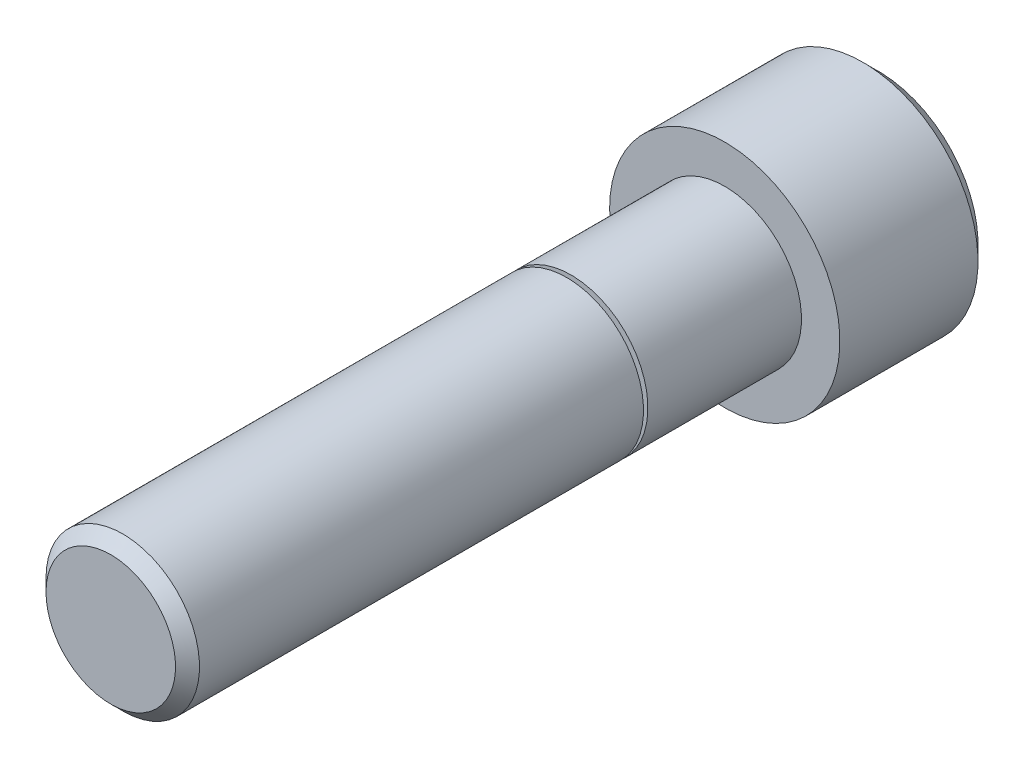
ISO-10303-21;
HEADER;
FILE_DESCRIPTION(('STEP AP214'),'2;1');
FILE_NAME('part.step','',(''),(''),'','','');
FILE_SCHEMA(('AUTOMOTIVE_DESIGN { 1 0 10303 214 1 1 1 1 }'));
ENDSEC;
DATA;
#1=APPLICATION_CONTEXT('core data for automotive mechanical design processes');
#2=APPLICATION_PROTOCOL_DEFINITION('international standard','automotive_design',2000,#1);
#3=PRODUCT_CONTEXT('',#1,'mechanical');
#4=PRODUCT('Part','Part','',(#3));
#5=PRODUCT_RELATED_PRODUCT_CATEGORY('part','',(#4));
#6=PRODUCT_DEFINITION_FORMATION('','',#4);
#7=PRODUCT_DEFINITION_CONTEXT('part definition',#1,'design');
#8=PRODUCT_DEFINITION('design','',#6,#7);
#9=PRODUCT_DEFINITION_SHAPE('','',#8);
#10=(LENGTH_UNIT() NAMED_UNIT(*) SI_UNIT(.MILLI.,.METRE.));
#11=(NAMED_UNIT(*) PLANE_ANGLE_UNIT() SI_UNIT($,.RADIAN.));
#12=(NAMED_UNIT(*) SI_UNIT($,.STERADIAN.) SOLID_ANGLE_UNIT());
#13=UNCERTAINTY_MEASURE_WITH_UNIT(LENGTH_MEASURE(1.E-05),#10,'distance_accuracy_value','');
#14=(GEOMETRIC_REPRESENTATION_CONTEXT(3) GLOBAL_UNCERTAINTY_ASSIGNED_CONTEXT((#13)) GLOBAL_UNIT_ASSIGNED_CONTEXT((#10,
#11,#12)) REPRESENTATION_CONTEXT('',''));
#15=CARTESIAN_POINT('',(0.,0.,0.));
#16=DIRECTION('',(0.,0.,1.));
#17=DIRECTION('',(1.,0.,0.));
#18=AXIS2_PLACEMENT_3D('',#15,#16,#17);
#19=CARTESIAN_POINT('',(0.,0.,-12.7));
#20=DIRECTION('',(0.,0.,1.));
#21=DIRECTION('',(1.,0.,0.));
#22=AXIS2_PLACEMENT_3D('',#19,#20,#21);
#23=PLANE('',#22);
#24=DIRECTION('',(-0.5,-0.866025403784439,0.));
#25=VECTOR('',#24,1.);
#26=CARTESIAN_POINT('',(5.49926131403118,0.,-12.7));
#27=LINE('',#26,#25);
#28=CARTESIAN_POINT('',(5.49926131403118,0.,-12.7));
#29=VERTEX_POINT('',#28);
#30=CARTESIAN_POINT('',(2.74963065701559,-4.76250000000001,-12.7));
#31=VERTEX_POINT('',#30);
#32=EDGE_CURVE('E145',#29,#31,#27,.T.);
#33=ORIENTED_EDGE('',*,*,#32,.F.);
#34=DIRECTION('',(0.5,-0.866025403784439,0.));
#35=VECTOR('',#34,1.);
#36=CARTESIAN_POINT('',(2.74963065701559,4.7625,-12.7));
#37=LINE('',#36,#35);
#38=CARTESIAN_POINT('',(2.74963065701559,4.7625,-12.7));
#39=VERTEX_POINT('',#38);
#40=EDGE_CURVE('E64',#39,#29,#37,.T.);
#41=ORIENTED_EDGE('',*,*,#40,.F.);
#42=DIRECTION('',(1.,0.,0.));
#43=VECTOR('',#42,1.);
#44=CARTESIAN_POINT('',(-2.74963065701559,4.7625,-12.7));
#45=LINE('',#44,#43);
#46=CARTESIAN_POINT('',(-2.74963065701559,4.7625,-12.7));
#47=VERTEX_POINT('',#46);
#48=EDGE_CURVE('E158',#47,#39,#45,.T.);
#49=ORIENTED_EDGE('',*,*,#48,.F.);
#50=DIRECTION('',(0.5,0.866025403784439,0.));
#51=VECTOR('',#50,1.);
#52=CARTESIAN_POINT('',(-5.49926131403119,0.,-12.7));
#53=LINE('',#52,#51);
#54=CARTESIAN_POINT('',(-5.49926131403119,0.,-12.7));
#55=VERTEX_POINT('',#54);
#56=EDGE_CURVE('E155',#55,#47,#53,.T.);
#57=ORIENTED_EDGE('',*,*,#56,.F.);
#58=DIRECTION('',(-0.5,0.866025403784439,0.));
#59=VECTOR('',#58,1.);
#60=CARTESIAN_POINT('',(-2.74963065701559,-4.76250000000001,-12.7));
#61=LINE('',#60,#59);
#62=CARTESIAN_POINT('',(-2.74963065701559,-4.76250000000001,-12.7));
#63=VERTEX_POINT('',#62);
#64=EDGE_CURVE('E112',#63,#55,#61,.T.);
#65=ORIENTED_EDGE('',*,*,#64,.F.);
#66=DIRECTION('',(-1.,0.,0.));
#67=VECTOR('',#66,1.);
#68=CARTESIAN_POINT('',(2.74963065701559,-4.76250000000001,-12.7));
#69=LINE('',#68,#67);
#70=EDGE_CURVE('E149',#31,#63,#69,.T.);
#71=ORIENTED_EDGE('',*,*,#70,.F.);
#72=EDGE_LOOP('',(#33,#41,#49,#57,#65,#71));
#73=FACE_BOUND('',#72,.T.);
#74=CARTESIAN_POINT('',(0.,0.,-12.7));
#75=DIRECTION('',(0.,0.,-1.));
#76=DIRECTION('',(-1.,0.,0.));
#77=AXIS2_PLACEMENT_3D('',#74,#75,#76);
#78=CIRCLE('',#77,8.255);
#79=CARTESIAN_POINT('',(-8.255,0.,-12.7));
#80=VERTEX_POINT('',#79);
#81=EDGE_CURVE('E164',#80,#80,#78,.T.);
#82=ORIENTED_EDGE('',*,*,#81,.T.);
#83=EDGE_LOOP('',(#82));
#84=FACE_BOUND('',#83,.T.);
#85=ADVANCED_FACE('F49',(#73,#84),#23,.F.);
#86=CARTESIAN_POINT('',(-5.35813000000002,0.,50.8));
#87=DIRECTION('',(0.,0.,-1.));
#88=DIRECTION('',(-1.,0.,0.));
#89=AXIS2_PLACEMENT_3D('',#86,#87,#88);
#90=PLANE('',#89);
#91=CARTESIAN_POINT('',(0.,0.,50.8));
#92=DIRECTION('',(0.,0.,-1.));
#93=DIRECTION('',(-1.,0.,0.));
#94=AXIS2_PLACEMENT_3D('',#91,#92,#93);
#95=CIRCLE('',#94,5.35813000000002);
#96=CARTESIAN_POINT('',(-5.35813000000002,0.,50.8));
#97=VERTEX_POINT('',#96);
#98=EDGE_CURVE('E11',#97,#97,#95,.T.);
#99=ORIENTED_EDGE('',*,*,#98,.F.);
#100=EDGE_LOOP('',(#99));
#101=FACE_BOUND('',#100,.T.);
#102=ADVANCED_FACE('F214',(#101),#90,.F.);
#103=CARTESIAN_POINT('',(0.,0.,50.8));
#104=DIRECTION('',(0.,0.,-1.));
#105=DIRECTION('',(-1.,0.,0.));
#106=AXIS2_PLACEMENT_3D('',#103,#104,#105);
#107=CONICAL_SURFACE('',#106,5.35813000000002,0.785398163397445);
#108=CARTESIAN_POINT('',(0.,0.,49.80813));
#109=DIRECTION('',(0.,0.,-1.));
#110=DIRECTION('',(-1.,0.,0.));
#111=AXIS2_PLACEMENT_3D('',#108,#109,#110);
#112=CIRCLE('',#111,6.35000000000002);
#113=CARTESIAN_POINT('',(-6.35000000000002,0.,49.80813));
#114=VERTEX_POINT('',#113);
#115=EDGE_CURVE('E57',#114,#114,#112,.T.);
#116=ORIENTED_EDGE('',*,*,#115,.F.);
#117=EDGE_LOOP('',(#116));
#118=FACE_BOUND('',#117,.T.);
#119=ORIENTED_EDGE('',*,*,#98,.T.);
#120=EDGE_LOOP('',(#119));
#121=FACE_BOUND('',#120,.T.);
#122=ADVANCED_FACE('F211',(#118,#121),#107,.T.);
#123=CARTESIAN_POINT('',(0.,0.,-10.585154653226));
#124=DIRECTION('',(0.,0.,-1.));
#125=DIRECTION('',(-1.,0.,0.));
#126=AXIS2_PLACEMENT_3D('',#123,#124,#125);
#127=CYLINDRICAL_SURFACE('',#126,6.35000000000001);
#128=CARTESIAN_POINT('',(0.,0.,13.0710111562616));
#129=DIRECTION('',(0.,0.,-1.));
#130=DIRECTION('',(-1.,0.,0.));
#131=AXIS2_PLACEMENT_3D('',#128,#129,#130);
#132=CIRCLE('',#131,6.35000000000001);
#133=CARTESIAN_POINT('',(-6.35000000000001,0.,13.0710111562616));
#134=VERTEX_POINT('',#133);
#135=EDGE_CURVE('E201',#134,#134,#132,.T.);
#136=ORIENTED_EDGE('',*,*,#135,.F.);
#137=EDGE_LOOP('',(#136));
#138=FACE_BOUND('',#137,.T.);
#139=ORIENTED_EDGE('',*,*,#115,.T.);
#140=EDGE_LOOP('',(#139));
#141=FACE_BOUND('',#140,.T.);
#142=ADVANCED_FACE('F209',(#138,#141),#127,.T.);
#143=CARTESIAN_POINT('',(0.,0.,13.0710111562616));
#144=DIRECTION('',(0.,0.,1.));
#145=DIRECTION('',(1.,0.,0.));
#146=AXIS2_PLACEMENT_3D('',#143,#144,#145);
#147=CONICAL_SURFACE('',#146,6.35000000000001,1.22173047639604);
#148=CARTESIAN_POINT('',(0.,0.,12.7487938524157));
#149=DIRECTION('',(0.,0.,-1.));
#150=DIRECTION('',(-1.,0.,0.));
#151=AXIS2_PLACEMENT_3D('',#148,#149,#150);
#152=CIRCLE('',#151,5.46471523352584);
#153=CARTESIAN_POINT('',(-5.46471523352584,0.,12.7487938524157));
#154=VERTEX_POINT('',#153);
#155=EDGE_CURVE('E197',#154,#154,#152,.T.);
#156=ORIENTED_EDGE('',*,*,#155,.F.);
#157=EDGE_LOOP('',(#156));
#158=FACE_BOUND('',#157,.T.);
#159=ORIENTED_EDGE('',*,*,#135,.T.);
#160=EDGE_LOOP('',(#159));
#161=FACE_BOUND('',#160,.T.);
#162=ADVANCED_FACE('F226',(#158,#161),#147,.T.);
#163=CARTESIAN_POINT('',(0.,0.,12.73));
#164=DIRECTION('',(0.,0.,-1.));
#165=DIRECTION('',(-1.,0.,0.));
#166=AXIS2_PLACEMENT_3D('',#163,#164,#165);
#167=TOROIDAL_SURFACE('',#166,5.47155563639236,0.0199999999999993);
#168=CARTESIAN_POINT('',(0.,0.,12.71));
#169=DIRECTION('',(0.,0.,-1.));
#170=DIRECTION('',(-1.,0.,0.));
#171=AXIS2_PLACEMENT_3D('',#168,#169,#170);
#172=CIRCLE('',#171,5.47155563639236);
#173=CARTESIAN_POINT('',(-5.47155563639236,0.,12.71));
#174=VERTEX_POINT('',#173);
#175=EDGE_CURVE('E193',#174,#174,#172,.T.);
#176=ORIENTED_EDGE('',*,*,#175,.F.);
#177=EDGE_LOOP('',(#176));
#178=FACE_BOUND('',#177,.T.);
#179=ORIENTED_EDGE('',*,*,#155,.T.);
#180=EDGE_LOOP('',(#179));
#181=FACE_BOUND('',#180,.T.);
#182=ADVANCED_FACE('F230',(#178,#181),#167,.F.);
#183=CARTESIAN_POINT('',(-6.35000000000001,0.,12.71));
#184=DIRECTION('',(0.,0.,-1.));
#185=DIRECTION('',(-1.,0.,0.));
#186=AXIS2_PLACEMENT_3D('',#183,#184,#185);
#187=PLANE('',#186);
#188=CARTESIAN_POINT('',(0.,0.,12.71));
#189=DIRECTION('',(0.,0.,-1.));
#190=DIRECTION('',(-1.,0.,0.));
#191=AXIS2_PLACEMENT_3D('',#188,#189,#190);
#192=CIRCLE('',#191,6.35000000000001);
#193=CARTESIAN_POINT('',(-6.35000000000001,0.,12.71));
#194=VERTEX_POINT('',#193);
#195=EDGE_CURVE('E189',#194,#194,#192,.T.);
#196=ORIENTED_EDGE('',*,*,#195,.F.);
#197=EDGE_LOOP('',(#196));
#198=FACE_BOUND('',#197,.T.);
#199=ORIENTED_EDGE('',*,*,#175,.T.);
#200=EDGE_LOOP('',(#199));
#201=FACE_BOUND('',#200,.T.);
#202=ADVANCED_FACE('F234',(#198,#201),#187,.F.);
#203=CARTESIAN_POINT('',(0.,0.,-10.585154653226));
#204=DIRECTION('',(0.,0.,-1.));
#205=DIRECTION('',(-1.,0.,0.));
#206=AXIS2_PLACEMENT_3D('',#203,#204,#205);
#207=CYLINDRICAL_SURFACE('',#206,6.35);
#208=CARTESIAN_POINT('',(0.,0.,0.));
#209=DIRECTION('',(0.,0.,-1.));
#210=DIRECTION('',(-1.,0.,0.));
#211=AXIS2_PLACEMENT_3D('',#208,#209,#210);
#212=CIRCLE('',#211,6.35);
#213=CARTESIAN_POINT('',(-6.35,0.,0.));
#214=VERTEX_POINT('',#213);
#215=EDGE_CURVE('E185',#214,#214,#212,.T.);
#216=ORIENTED_EDGE('',*,*,#215,.F.);
#217=EDGE_LOOP('',(#216));
#218=FACE_BOUND('',#217,.T.);
#219=ORIENTED_EDGE('',*,*,#195,.T.);
#220=EDGE_LOOP('',(#219));
#221=FACE_BOUND('',#220,.T.);
#222=ADVANCED_FACE('F238',(#218,#221),#207,.T.);
#223=CARTESIAN_POINT('',(-9.525,0.,0.));
#224=DIRECTION('',(0.,0.,-1.));
#225=DIRECTION('',(-1.,0.,0.));
#226=AXIS2_PLACEMENT_3D('',#223,#224,#225);
#227=PLANE('',#226);
#228=CARTESIAN_POINT('',(0.,0.,0.));
#229=DIRECTION('',(0.,0.,-1.));
#230=DIRECTION('',(-1.,0.,0.));
#231=AXIS2_PLACEMENT_3D('',#228,#229,#230);
#232=CIRCLE('',#231,9.525);
#233=CARTESIAN_POINT('',(-9.525,0.,0.));
#234=VERTEX_POINT('',#233);
#235=EDGE_CURVE('E181',#234,#234,#232,.T.);
#236=ORIENTED_EDGE('',*,*,#235,.F.);
#237=EDGE_LOOP('',(#236));
#238=FACE_BOUND('',#237,.T.);
#239=ORIENTED_EDGE('',*,*,#215,.T.);
#240=EDGE_LOOP('',(#239));
#241=FACE_BOUND('',#240,.T.);
#242=ADVANCED_FACE('F242',(#238,#241),#227,.F.);
#243=CARTESIAN_POINT('',(0.,0.,-10.585154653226));
#244=DIRECTION('',(0.,0.,-1.));
#245=DIRECTION('',(-1.,0.,0.));
#246=AXIS2_PLACEMENT_3D('',#243,#244,#245);
#247=CYLINDRICAL_SURFACE('',#246,9.525);
#248=CARTESIAN_POINT('',(0.,0.,-11.43));
#249=DIRECTION('',(0.,0.,-1.));
#250=DIRECTION('',(-1.,0.,0.));
#251=AXIS2_PLACEMENT_3D('',#248,#249,#250);
#252=CIRCLE('',#251,9.525);
#253=CARTESIAN_POINT('',(-9.525,0.,-11.43));
#254=VERTEX_POINT('',#253);
#255=EDGE_CURVE('E177',#254,#254,#252,.T.);
#256=ORIENTED_EDGE('',*,*,#255,.F.);
#257=EDGE_LOOP('',(#256));
#258=FACE_BOUND('',#257,.T.);
#259=ORIENTED_EDGE('',*,*,#235,.T.);
#260=EDGE_LOOP('',(#259));
#261=FACE_BOUND('',#260,.T.);
#262=ADVANCED_FACE('F246',(#258,#261),#247,.T.);
#263=CARTESIAN_POINT('',(0.,0.,-11.43));
#264=DIRECTION('',(0.,0.,1.));
#265=DIRECTION('',(1.,0.,0.));
#266=AXIS2_PLACEMENT_3D('',#263,#264,#265);
#267=CONICAL_SURFACE('',#266,9.525,0.785398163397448);
#268=ORIENTED_EDGE('',*,*,#81,.F.);
#269=EDGE_LOOP('',(#268));
#270=FACE_BOUND('',#269,.T.);
#271=ORIENTED_EDGE('',*,*,#255,.T.);
#272=EDGE_LOOP('',(#271));
#273=FACE_BOUND('',#272,.T.);
#274=ADVANCED_FACE('F250',(#270,#273),#267,.T.);
#275=CARTESIAN_POINT('',(2.74963065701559,4.7625,-6.35));
#276=DIRECTION('',(0.866025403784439,0.5,0.));
#277=DIRECTION('',(-0.5,0.866025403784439,0.));
#278=AXIS2_PLACEMENT_3D('',#275,#276,#277);
#279=PLANE('',#278);
#280=ORIENTED_EDGE('',*,*,#40,.T.);
#281=DIRECTION('',(0.,0.,-1.));
#282=VECTOR('',#281,1.);
#283=CARTESIAN_POINT('',(5.49926131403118,0.,-6.35));
#284=LINE('',#283,#282);
#285=CARTESIAN_POINT('',(5.49926131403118,0.,-6.35));
#286=VERTEX_POINT('',#285);
#287=EDGE_CURVE('E94',#286,#29,#284,.T.);
#288=ORIENTED_EDGE('',*,*,#287,.F.);
#289=DIRECTION('',(0.5,-0.866025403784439,0.));
#290=VECTOR('',#289,1.);
#291=CARTESIAN_POINT('',(2.74963065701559,4.7625,-6.35));
#292=LINE('',#291,#290);
#293=CARTESIAN_POINT('',(2.74963065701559,4.7625,-6.35));
#294=VERTEX_POINT('',#293);
#295=EDGE_CURVE('E161',#294,#286,#292,.T.);
#296=ORIENTED_EDGE('',*,*,#295,.F.);
#297=DIRECTION('',(0.,0.,-1.));
#298=VECTOR('',#297,1.);
#299=CARTESIAN_POINT('',(2.74963065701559,4.7625,-6.35));
#300=LINE('',#299,#298);
#301=EDGE_CURVE('E72',#294,#39,#300,.T.);
#302=ORIENTED_EDGE('',*,*,#301,.T.);
#303=EDGE_LOOP('',(#280,#288,#296,#302));
#304=FACE_BOUND('',#303,.T.);
#305=ADVANCED_FACE('F254',(#304),#279,.F.);
#306=CARTESIAN_POINT('',(-2.74963065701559,4.7625,-6.35));
#307=DIRECTION('',(0.,1.,0.));
#308=DIRECTION('',(0.,0.,1.));
#309=AXIS2_PLACEMENT_3D('',#306,#307,#308);
#310=PLANE('',#309);
#311=ORIENTED_EDGE('',*,*,#48,.T.);
#312=ORIENTED_EDGE('',*,*,#301,.F.);
#313=DIRECTION('',(1.,0.,0.));
#314=VECTOR('',#313,1.);
#315=CARTESIAN_POINT('',(-2.74963065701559,4.7625,-6.35));
#316=LINE('',#315,#314);
#317=CARTESIAN_POINT('',(-2.74963065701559,4.7625,-6.35));
#318=VERTEX_POINT('',#317);
#319=EDGE_CURVE('E126',#318,#294,#316,.T.);
#320=ORIENTED_EDGE('',*,*,#319,.F.);
#321=DIRECTION('',(0.,0.,-1.));
#322=VECTOR('',#321,1.);
#323=CARTESIAN_POINT('',(-2.74963065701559,4.7625,-6.35));
#324=LINE('',#323,#322);
#325=EDGE_CURVE('E117',#318,#47,#324,.T.);
#326=ORIENTED_EDGE('',*,*,#325,.T.);
#327=EDGE_LOOP('',(#311,#312,#320,#326));
#328=FACE_BOUND('',#327,.T.);
#329=ADVANCED_FACE('F258',(#328),#310,.F.);
#330=CARTESIAN_POINT('',(-5.49926131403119,0.,-6.35));
#331=DIRECTION('',(-0.866025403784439,0.5,0.));
#332=DIRECTION('',(-0.5,-0.866025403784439,0.));
#333=AXIS2_PLACEMENT_3D('',#330,#331,#332);
#334=PLANE('',#333);
#335=ORIENTED_EDGE('',*,*,#56,.T.);
#336=ORIENTED_EDGE('',*,*,#325,.F.);
#337=DIRECTION('',(0.5,0.866025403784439,0.));
#338=VECTOR('',#337,1.);
#339=CARTESIAN_POINT('',(-5.49926131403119,0.,-6.35));
#340=LINE('',#339,#338);
#341=CARTESIAN_POINT('',(-5.49926131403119,0.,-6.35));
#342=VERTEX_POINT('',#341);
#343=EDGE_CURVE('E121',#342,#318,#340,.T.);
#344=ORIENTED_EDGE('',*,*,#343,.F.);
#345=DIRECTION('',(0.,0.,-1.));
#346=VECTOR('',#345,1.);
#347=CARTESIAN_POINT('',(-5.49926131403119,0.,-6.35));
#348=LINE('',#347,#346);
#349=EDGE_CURVE('E105',#342,#55,#348,.T.);
#350=ORIENTED_EDGE('',*,*,#349,.T.);
#351=EDGE_LOOP('',(#335,#336,#344,#350));
#352=FACE_BOUND('',#351,.T.);
#353=ADVANCED_FACE('F122',(#352),#334,.F.);
#354=CARTESIAN_POINT('',(-2.74963065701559,-4.76250000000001,-6.35));
#355=DIRECTION('',(-0.866025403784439,-0.5,0.));
#356=DIRECTION('',(0.5,-0.866025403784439,0.));
#357=AXIS2_PLACEMENT_3D('',#354,#355,#356);
#358=PLANE('',#357);
#359=ORIENTED_EDGE('',*,*,#64,.T.);
#360=ORIENTED_EDGE('',*,*,#349,.F.);
#361=DIRECTION('',(-0.5,0.866025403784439,0.));
#362=VECTOR('',#361,1.);
#363=CARTESIAN_POINT('',(-2.74963065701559,-4.76250000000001,-6.35));
#364=LINE('',#363,#362);
#365=CARTESIAN_POINT('',(-2.74963065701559,-4.76250000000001,-6.35));
#366=VERTEX_POINT('',#365);
#367=EDGE_CURVE('E109',#366,#342,#364,.T.);
#368=ORIENTED_EDGE('',*,*,#367,.F.);
#369=DIRECTION('',(0.,0.,-1.));
#370=VECTOR('',#369,1.);
#371=CARTESIAN_POINT('',(-2.74963065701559,-4.76250000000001,-6.35));
#372=LINE('',#371,#370);
#373=EDGE_CURVE('E118',#366,#63,#372,.T.);
#374=ORIENTED_EDGE('',*,*,#373,.T.);
#375=EDGE_LOOP('',(#359,#360,#368,#374));
#376=FACE_BOUND('',#375,.T.);
#377=ADVANCED_FACE('F107',(#376),#358,.F.);
#378=CARTESIAN_POINT('',(2.74963065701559,-4.76250000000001,-6.35));
#379=DIRECTION('',(0.,-1.,0.));
#380=DIRECTION('',(0.,0.,-1.));
#381=AXIS2_PLACEMENT_3D('',#378,#379,#380);
#382=PLANE('',#381);
#383=ORIENTED_EDGE('',*,*,#70,.T.);
#384=ORIENTED_EDGE('',*,*,#373,.F.);
#385=DIRECTION('',(-1.,0.,0.));
#386=VECTOR('',#385,1.);
#387=CARTESIAN_POINT('',(2.74963065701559,-4.76250000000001,-6.35));
#388=LINE('',#387,#386);
#389=CARTESIAN_POINT('',(2.74963065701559,-4.76250000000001,-6.35));
#390=VERTEX_POINT('',#389);
#391=EDGE_CURVE('E132',#390,#366,#388,.T.);
#392=ORIENTED_EDGE('',*,*,#391,.F.);
#393=DIRECTION('',(0.,0.,-1.));
#394=VECTOR('',#393,1.);
#395=CARTESIAN_POINT('',(2.74963065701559,-4.76250000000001,-6.35));
#396=LINE('',#395,#394);
#397=EDGE_CURVE('E169',#390,#31,#396,.T.);
#398=ORIENTED_EDGE('',*,*,#397,.T.);
#399=EDGE_LOOP('',(#383,#384,#392,#398));
#400=FACE_BOUND('',#399,.T.);
#401=ADVANCED_FACE('F262',(#400),#382,.F.);
#402=CARTESIAN_POINT('',(5.49926131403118,0.,-6.35));
#403=DIRECTION('',(0.866025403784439,-0.5,0.));
#404=DIRECTION('',(0.5,0.866025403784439,0.));
#405=AXIS2_PLACEMENT_3D('',#402,#403,#404);
#406=PLANE('',#405);
#407=ORIENTED_EDGE('',*,*,#32,.T.);
#408=ORIENTED_EDGE('',*,*,#397,.F.);
#409=DIRECTION('',(-0.5,-0.866025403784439,0.));
#410=VECTOR('',#409,1.);
#411=CARTESIAN_POINT('',(5.49926131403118,0.,-6.35));
#412=LINE('',#411,#410);
#413=EDGE_CURVE('E137',#286,#390,#412,.T.);
#414=ORIENTED_EDGE('',*,*,#413,.F.);
#415=ORIENTED_EDGE('',*,*,#287,.T.);
#416=EDGE_LOOP('',(#407,#408,#414,#415));
#417=FACE_BOUND('',#416,.T.);
#418=ADVANCED_FACE('F259',(#417),#406,.F.);
#419=CARTESIAN_POINT('',(8.24889197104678,-4.76250000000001,-6.35));
#420=DIRECTION('',(0.,0.,-1.));
#421=DIRECTION('',(-1.,0.,0.));
#422=AXIS2_PLACEMENT_3D('',#419,#420,#421);
#423=PLANE('',#422);
#424=ORIENTED_EDGE('',*,*,#295,.T.);
#425=ORIENTED_EDGE('',*,*,#413,.T.);
#426=ORIENTED_EDGE('',*,*,#391,.T.);
#427=ORIENTED_EDGE('',*,*,#367,.T.);
#428=ORIENTED_EDGE('',*,*,#343,.T.);
#429=ORIENTED_EDGE('',*,*,#319,.T.);
#430=EDGE_LOOP('',(#424,#425,#426,#427,#428,#429));
#431=FACE_BOUND('',#430,.T.);
#432=ADVANCED_FACE('F129',(#431),#423,.T.);
#433=CLOSED_SHELL('',(#85,#102,#122,#142,#162,#182,#202,#222,#242,#262,#274,#305,#329,#353,#377,
#401,#418,#432));
#434=MANIFOLD_SOLID_BREP('B2',#433);
#435=ADVANCED_BREP_SHAPE_REPRESENTATION('',(#18,#434),#14);
#436=SHAPE_DEFINITION_REPRESENTATION(#9,#435);
ENDSEC;
END-ISO-10303-21;
